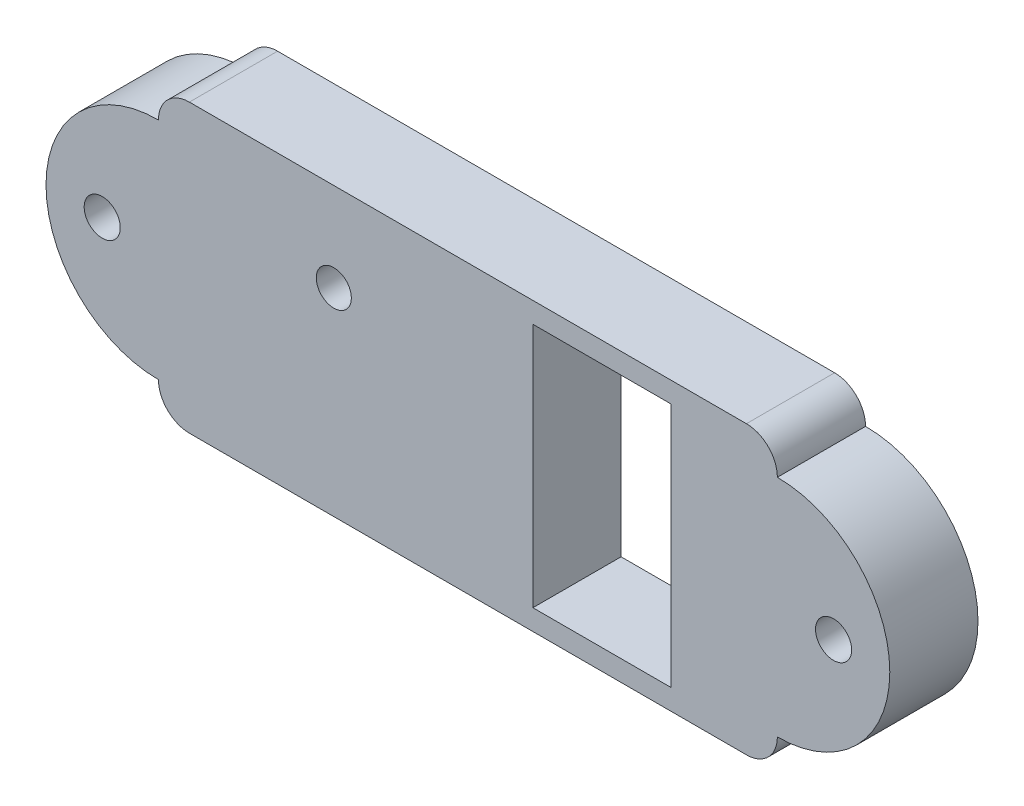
from build123d import *

# Parameters (mm, degrees)
ESQUISSE1_R        = 1.7
ESQUISSE1_W        = 13.4
ESQUISSE1_H        = 23.8
BOSS_EXTRU_1_DEPTH = 8.55
ESQUISSE3_R        = 1.75
BOSS_EXTRU_3_DEPTH = 8.55


with BuildPart() as part:
    # Esquisse1 → Boss.-Extru.1 (new body)
    with BuildSketch(Plane.XY):
        with BuildLine():
            ThreePointArc((-27, -19.2), (-29.121320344, -18.321320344), (-30, -16.2))
            Line((-30, -16.2), (-30, 5.6))
            ThreePointArc((-30, 5.6), (-29.121320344, 7.721320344), (-27, 8.6))
            Line((-27, 8.6), (0, 8.6))
            Line((0, 8.6), (27, 8.6))
            ThreePointArc((27, 8.6), (29.121320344, 7.721320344), (30, 5.6))
            Line((30, 5.6), (30, -16.2))
            ThreePointArc((30, -16.2), (29.121320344, -18.321320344), (27, -19.2))
            Line((27, -19.2), (-27, -19.2))
        make_face()
        with Locations((-13, 0)):
            Circle(ESQUISSE1_R, mode=Mode.SUBTRACT)
        with Locations((13, -5.3)):
            Rectangle(ESQUISSE1_W, ESQUISSE1_H, mode=Mode.SUBTRACT)
    extrude(amount=BOSS_EXTRU_1_DEPTH)

    # Esquisse3 → Boss.-Extru.3 (add)
    # profile 1 of 2: a face of its own
    with BuildSketch(Plane(origin=(0, 0, 0), x_dir=(-1, 0, 0), z_dir=(0, 0, -1))):
        with BuildLine():
            Line((-30, 5.6), (-30, -16.2))
            ThreePointArc((-30, -16.2), (-40.9, -5.3), (-30, 5.6))
        make_face()
        with Locations((-35.45, -5.3)):
            Circle(ESQUISSE3_R, mode=Mode.SUBTRACT)
    # profile 2 of 2: a face of its own
    with BuildSketch(Plane(origin=(0, 0, 0), x_dir=(-1, 0, 0), z_dir=(0, 0, -1))):
        with BuildLine():
            Line((30, 5.6), (30, -16.2))
            ThreePointArc((30, -16.2), (40.9, -5.3), (30, 5.6))
        make_face()
        with Locations((35.45, -5.3)):
            Circle(ESQUISSE3_R, mode=Mode.SUBTRACT)
    extrude(amount=-BOSS_EXTRU_3_DEPTH)


solid = part.part
